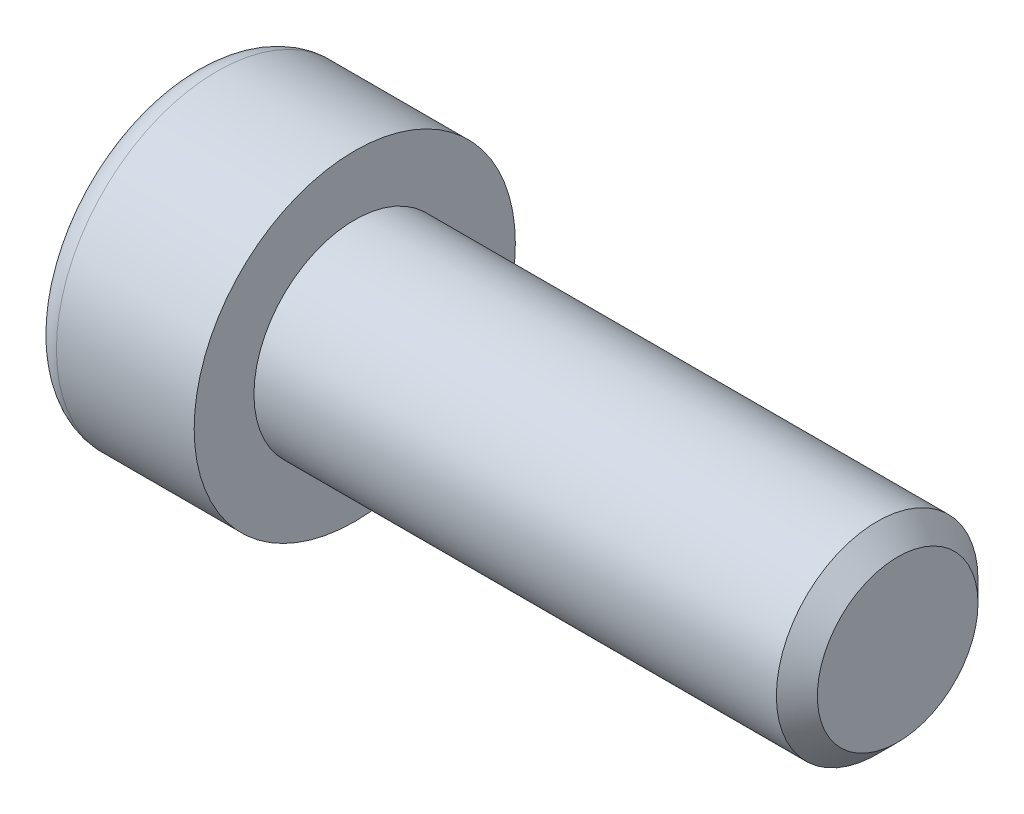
ISO-10303-21;
HEADER;
FILE_DESCRIPTION(('STEP AP214'),'2;1');
FILE_NAME('part.step','',(''),(''),'','','');
FILE_SCHEMA(('AUTOMOTIVE_DESIGN { 1 0 10303 214 1 1 1 1 }'));
ENDSEC;
DATA;
#1=APPLICATION_CONTEXT('core data for automotive mechanical design processes');
#2=APPLICATION_PROTOCOL_DEFINITION('international standard','automotive_design',2000,#1);
#3=PRODUCT_CONTEXT('',#1,'mechanical');
#4=PRODUCT('Part','Part','',(#3));
#5=PRODUCT_RELATED_PRODUCT_CATEGORY('part','',(#4));
#6=PRODUCT_DEFINITION_FORMATION('','',#4);
#7=PRODUCT_DEFINITION_CONTEXT('part definition',#1,'design');
#8=PRODUCT_DEFINITION('design','',#6,#7);
#9=PRODUCT_DEFINITION_SHAPE('','',#8);
#10=(LENGTH_UNIT() NAMED_UNIT(*) SI_UNIT(.MILLI.,.METRE.));
#11=(NAMED_UNIT(*) PLANE_ANGLE_UNIT() SI_UNIT($,.RADIAN.));
#12=(NAMED_UNIT(*) SI_UNIT($,.STERADIAN.) SOLID_ANGLE_UNIT());
#13=UNCERTAINTY_MEASURE_WITH_UNIT(LENGTH_MEASURE(1.E-05),#10,'distance_accuracy_value','');
#14=(GEOMETRIC_REPRESENTATION_CONTEXT(3) GLOBAL_UNCERTAINTY_ASSIGNED_CONTEXT((#13)) GLOBAL_UNIT_ASSIGNED_CONTEXT((#10,
#11,#12)) REPRESENTATION_CONTEXT('',''));
#15=CARTESIAN_POINT('',(0.,0.,0.));
#16=DIRECTION('',(0.,0.,1.));
#17=DIRECTION('',(1.,0.,0.));
#18=AXIS2_PLACEMENT_3D('',#15,#16,#17);
#19=CARTESIAN_POINT('',(-410.916586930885,342.451739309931,0.));
#20=DIRECTION('',(1.,0.,0.));
#21=DIRECTION('',(0.,0.,-1.));
#22=AXIS2_PLACEMENT_3D('',#19,#20,#21);
#23=TOROIDAL_SURFACE('',#22,5.37136329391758,1.00000000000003);
#24=CARTESIAN_POINT('',(-411.916586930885,342.451739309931,0.));
#25=DIRECTION('',(1.,0.,0.));
#26=DIRECTION('',(0.,0.,-1.));
#27=AXIS2_PLACEMENT_3D('',#24,#25,#26);
#28=CIRCLE('',#27,5.37136329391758);
#29=CARTESIAN_POINT('',(-411.916586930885,342.451739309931,-5.37136329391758));
#30=VERTEX_POINT('',#29);
#31=EDGE_CURVE('E161',#30,#30,#28,.T.);
#32=ORIENTED_EDGE('',*,*,#31,.T.);
#33=EDGE_LOOP('',(#32));
#34=FACE_BOUND('',#33,.T.);
#35=CARTESIAN_POINT('',(-410.916586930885,342.451739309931,0.));
#36=DIRECTION('',(1.,0.,0.));
#37=DIRECTION('',(0.,0.,-1.));
#38=AXIS2_PLACEMENT_3D('',#35,#36,#37);
#39=CIRCLE('',#38,6.37136329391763);
#40=CARTESIAN_POINT('',(-410.916586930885,342.451739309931,-6.37136329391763));
#41=VERTEX_POINT('',#40);
#42=EDGE_CURVE('E140',#41,#41,#39,.T.);
#43=ORIENTED_EDGE('',*,*,#42,.F.);
#44=EDGE_LOOP('',(#43));
#45=FACE_BOUND('',#44,.T.);
#46=ADVANCED_FACE('F35',(#34,#45),#23,.T.);
#47=CARTESIAN_POINT('',(-411.916586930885,342.451739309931,0.));
#48=DIRECTION('',(-1.,0.,0.));
#49=DIRECTION('',(0.,0.,1.));
#50=AXIS2_PLACEMENT_3D('',#47,#48,#49);
#51=PLANE('',#50);
#52=DIRECTION('',(0.,-0.695106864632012,-0.718906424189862));
#53=VECTOR('',#52,1.);
#54=CARTESIAN_POINT('',(-411.916586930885,345.750700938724,-0.824709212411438));
#55=LINE('',#54,#53);
#56=CARTESIAN_POINT('',(-411.916586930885,345.750700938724,-0.824709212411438));
#57=VERTEX_POINT('',#56);
#58=CARTESIAN_POINT('',(-411.916586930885,343.387000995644,-3.26933918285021));
#59=VERTEX_POINT('',#58);
#60=EDGE_CURVE('E121',#57,#59,#55,.T.);
#61=ORIENTED_EDGE('',*,*,#60,.F.);
#62=DIRECTION('',(0.,0.275037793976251,-0.961433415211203));
#63=VECTOR('',#62,1.);
#64=CARTESIAN_POINT('',(-411.916586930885,344.815439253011,2.44462997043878));
#65=LINE('',#64,#63);
#66=CARTESIAN_POINT('',(-411.916586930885,344.815439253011,2.44462997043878));
#67=VERTEX_POINT('',#66);
#68=EDGE_CURVE('E135',#67,#57,#65,.T.);
#69=ORIENTED_EDGE('',*,*,#68,.F.);
#70=DIRECTION('',(0.,0.970144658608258,-0.242526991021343));
#71=VECTOR('',#70,1.);
#72=CARTESIAN_POINT('',(-411.916586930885,341.516477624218,3.26933918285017));
#73=LINE('',#72,#71);
#74=CARTESIAN_POINT('',(-411.916586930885,341.516477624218,3.26933918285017));
#75=VERTEX_POINT('',#74);
#76=EDGE_CURVE('E129',#75,#67,#73,.T.);
#77=ORIENTED_EDGE('',*,*,#76,.F.);
#78=DIRECTION('',(0.,0.695106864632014,0.71890642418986));
#79=VECTOR('',#78,1.);
#80=CARTESIAN_POINT('',(-411.916586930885,339.152777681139,0.824709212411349));
#81=LINE('',#80,#79);
#82=CARTESIAN_POINT('',(-411.916586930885,339.152777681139,0.824709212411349));
#83=VERTEX_POINT('',#82);
#84=EDGE_CURVE('E127',#83,#75,#81,.T.);
#85=ORIENTED_EDGE('',*,*,#84,.F.);
#86=DIRECTION('',(0.,-0.275037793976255,0.961433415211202));
#87=VECTOR('',#86,1.);
#88=CARTESIAN_POINT('',(-411.916586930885,340.088039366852,-2.44462997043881));
#89=LINE('',#88,#87);
#90=CARTESIAN_POINT('',(-411.916586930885,340.088039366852,-2.44462997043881));
#91=VERTEX_POINT('',#90);
#92=EDGE_CURVE('E109',#91,#83,#89,.T.);
#93=ORIENTED_EDGE('',*,*,#92,.F.);
#94=DIRECTION('',(0.,-0.970144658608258,0.242526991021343));
#95=VECTOR('',#94,1.);
#96=CARTESIAN_POINT('',(-411.916586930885,343.387000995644,-3.26933918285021));
#97=LINE('',#96,#95);
#98=EDGE_CURVE('E116',#59,#91,#97,.T.);
#99=ORIENTED_EDGE('',*,*,#98,.F.);
#100=EDGE_LOOP('',(#61,#69,#77,#85,#93,#99));
#101=FACE_BOUND('',#100,.T.);
#102=ORIENTED_EDGE('',*,*,#31,.F.);
#103=EDGE_LOOP('',(#102));
#104=FACE_BOUND('',#103,.T.);
#105=ADVANCED_FACE('F123',(#101,#104),#51,.T.);
#106=CARTESIAN_POINT('',(-383.911125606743,345.638750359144,0.));
#107=DIRECTION('',(1.,0.,0.));
#108=DIRECTION('',(0.,0.,-1.));
#109=AXIS2_PLACEMENT_3D('',#106,#107,#108);
#110=PLANE('',#109);
#111=CARTESIAN_POINT('',(-383.911125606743,342.451739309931,0.));
#112=DIRECTION('',(1.,0.,0.));
#113=DIRECTION('',(0.,0.,-1.));
#114=AXIS2_PLACEMENT_3D('',#111,#112,#113);
#115=CIRCLE('',#114,3.18701104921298);
#116=CARTESIAN_POINT('',(-383.911125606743,342.451739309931,-3.18701104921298));
#117=VERTEX_POINT('',#116);
#118=EDGE_CURVE('E158',#117,#117,#115,.T.);
#119=ORIENTED_EDGE('',*,*,#118,.T.);
#120=EDGE_LOOP('',(#119));
#121=FACE_BOUND('',#120,.T.);
#122=ADVANCED_FACE('F252',(#121),#110,.T.);
#123=CARTESIAN_POINT('',(-383.911125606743,342.451739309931,0.));
#124=DIRECTION('',(-1.,0.,0.));
#125=DIRECTION('',(0.,0.,1.));
#126=AXIS2_PLACEMENT_3D('',#123,#124,#125);
#127=CONICAL_SURFACE('',#126,3.18701104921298,0.785398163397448);
#128=CARTESIAN_POINT('',(-384.72411455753,342.451739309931,0.));
#129=DIRECTION('',(1.,0.,0.));
#130=DIRECTION('',(0.,0.,-1.));
#131=AXIS2_PLACEMENT_3D('',#128,#129,#130);
#132=CIRCLE('',#131,4.00000000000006);
#133=CARTESIAN_POINT('',(-384.72411455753,342.451739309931,-4.00000000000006));
#134=VERTEX_POINT('',#133);
#135=EDGE_CURVE('E155',#134,#134,#132,.T.);
#136=ORIENTED_EDGE('',*,*,#135,.T.);
#137=EDGE_LOOP('',(#136));
#138=FACE_BOUND('',#137,.T.);
#139=ORIENTED_EDGE('',*,*,#118,.F.);
#140=EDGE_LOOP('',(#139));
#141=FACE_BOUND('',#140,.T.);
#142=ADVANCED_FACE('F370',(#138,#141),#127,.T.);
#143=CARTESIAN_POINT('',(-383.911125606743,342.451739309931,0.));
#144=DIRECTION('',(1.,0.,0.));
#145=DIRECTION('',(0.,0.,-1.));
#146=AXIS2_PLACEMENT_3D('',#143,#144,#145);
#147=CYLINDRICAL_SURFACE('',#146,4.00000000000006);
#148=CARTESIAN_POINT('',(-405.451180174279,342.451739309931,0.));
#149=DIRECTION('',(1.,0.,0.));
#150=DIRECTION('',(0.,0.,-1.));
#151=AXIS2_PLACEMENT_3D('',#148,#149,#150);
#152=CIRCLE('',#151,4.00000000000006);
#153=CARTESIAN_POINT('',(-405.451180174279,342.451739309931,-4.00000000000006));
#154=VERTEX_POINT('',#153);
#155=EDGE_CURVE('E152',#154,#154,#152,.T.);
#156=ORIENTED_EDGE('',*,*,#155,.T.);
#157=EDGE_LOOP('',(#156));
#158=FACE_BOUND('',#157,.T.);
#159=ORIENTED_EDGE('',*,*,#135,.F.);
#160=EDGE_LOOP('',(#159));
#161=FACE_BOUND('',#160,.T.);
#162=ADVANCED_FACE('F361',(#158,#161),#147,.T.);
#163=CARTESIAN_POINT('',(-405.451180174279,346.451739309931,0.));
#164=DIRECTION('',(1.,0.,0.));
#165=DIRECTION('',(0.,0.,-1.));
#166=AXIS2_PLACEMENT_3D('',#163,#164,#165);
#167=PLANE('',#166);
#168=CARTESIAN_POINT('',(-405.451180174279,342.451739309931,0.));
#169=DIRECTION('',(1.,0.,0.));
#170=DIRECTION('',(0.,0.,-1.));
#171=AXIS2_PLACEMENT_3D('',#168,#169,#170);
#172=CIRCLE('',#171,6.37136329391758);
#173=CARTESIAN_POINT('',(-405.451180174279,342.451739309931,-6.37136329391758));
#174=VERTEX_POINT('',#173);
#175=EDGE_CURVE('E149',#174,#174,#172,.T.);
#176=ORIENTED_EDGE('',*,*,#175,.T.);
#177=EDGE_LOOP('',(#176));
#178=FACE_BOUND('',#177,.T.);
#179=ORIENTED_EDGE('',*,*,#155,.F.);
#180=EDGE_LOOP('',(#179));
#181=FACE_BOUND('',#180,.T.);
#182=ADVANCED_FACE('F352',(#178,#181),#167,.T.);
#183=CARTESIAN_POINT('',(-383.911125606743,342.451739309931,0.));
#184=DIRECTION('',(1.,0.,0.));
#185=DIRECTION('',(0.,0.,-1.));
#186=AXIS2_PLACEMENT_3D('',#183,#184,#185);
#187=CYLINDRICAL_SURFACE('',#186,6.3713632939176);
#188=ORIENTED_EDGE('',*,*,#42,.T.);
#189=EDGE_LOOP('',(#188));
#190=FACE_BOUND('',#189,.T.);
#191=ORIENTED_EDGE('',*,*,#175,.F.);
#192=EDGE_LOOP('',(#191));
#193=FACE_BOUND('',#192,.T.);
#194=ADVANCED_FACE('F343',(#190,#193),#187,.T.);
#195=CARTESIAN_POINT('',(-408.916586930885,345.750700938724,-0.824709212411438));
#196=DIRECTION('',(0.,0.718906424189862,-0.695106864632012));
#197=DIRECTION('',(0.,0.695106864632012,0.718906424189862));
#198=AXIS2_PLACEMENT_3D('',#195,#196,#197);
#199=PLANE('',#198);
#200=DIRECTION('',(-1.,0.,0.));
#201=VECTOR('',#200,1.);
#202=CARTESIAN_POINT('',(-408.916586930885,343.387000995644,-3.26933918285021));
#203=LINE('',#202,#201);
#204=CARTESIAN_POINT('',(-409.416586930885,343.387000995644,-3.26933918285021));
#205=VERTEX_POINT('',#204);
#206=EDGE_CURVE('E113',#205,#59,#203,.T.);
#207=ORIENTED_EDGE('',*,*,#206,.F.);
#208=DIRECTION('',(0.,-0.695106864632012,-0.718906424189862));
#209=VECTOR('',#208,1.);
#210=CARTESIAN_POINT('',(-409.416586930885,345.750700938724,-0.824709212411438));
#211=LINE('',#210,#209);
#212=CARTESIAN_POINT('',(-409.416586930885,345.750700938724,-0.824709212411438));
#213=VERTEX_POINT('',#212);
#214=EDGE_CURVE('E11',#205,#213,#211,.F.);
#215=ORIENTED_EDGE('',*,*,#214,.T.);
#216=DIRECTION('',(-1.,0.,0.));
#217=VECTOR('',#216,1.);
#218=CARTESIAN_POINT('',(-408.916586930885,345.750700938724,-0.824709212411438));
#219=LINE('',#218,#217);
#220=EDGE_CURVE('E138',#213,#57,#219,.T.);
#221=ORIENTED_EDGE('',*,*,#220,.T.);
#222=ORIENTED_EDGE('',*,*,#60,.T.);
#223=EDGE_LOOP('',(#207,#215,#221,#222));
#224=FACE_BOUND('',#223,.T.);
#225=ADVANCED_FACE('F205',(#224),#199,.F.);
#226=CARTESIAN_POINT('',(-408.916586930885,344.815439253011,2.44462997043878));
#227=DIRECTION('',(0.,0.961433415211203,0.275037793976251));
#228=DIRECTION('',(0.,-0.275037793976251,0.961433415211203));
#229=AXIS2_PLACEMENT_3D('',#226,#227,#228);
#230=PLANE('',#229);
#231=ORIENTED_EDGE('',*,*,#220,.F.);
#232=DIRECTION('',(0.,0.275037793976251,-0.961433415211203));
#233=VECTOR('',#232,1.);
#234=CARTESIAN_POINT('',(-409.416586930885,344.815439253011,2.44462997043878));
#235=LINE('',#234,#233);
#236=CARTESIAN_POINT('',(-409.416586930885,344.815439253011,2.44462997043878));
#237=VERTEX_POINT('',#236);
#238=EDGE_CURVE('E177',#213,#237,#235,.F.);
#239=ORIENTED_EDGE('',*,*,#238,.T.);
#240=DIRECTION('',(-1.,0.,0.));
#241=VECTOR('',#240,1.);
#242=CARTESIAN_POINT('',(-408.916586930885,344.815439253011,2.44462997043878));
#243=LINE('',#242,#241);
#244=EDGE_CURVE('E141',#237,#67,#243,.T.);
#245=ORIENTED_EDGE('',*,*,#244,.T.);
#246=ORIENTED_EDGE('',*,*,#68,.T.);
#247=EDGE_LOOP('',(#231,#239,#245,#246));
#248=FACE_BOUND('',#247,.T.);
#249=ADVANCED_FACE('F210',(#248),#230,.F.);
#250=CARTESIAN_POINT('',(-408.916586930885,341.516477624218,3.26933918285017));
#251=DIRECTION('',(0.,0.242526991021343,0.970144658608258));
#252=DIRECTION('',(0.,-0.970144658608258,0.242526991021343));
#253=AXIS2_PLACEMENT_3D('',#250,#251,#252);
#254=PLANE('',#253);
#255=ORIENTED_EDGE('',*,*,#244,.F.);
#256=DIRECTION('',(0.,0.970144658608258,-0.242526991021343));
#257=VECTOR('',#256,1.);
#258=CARTESIAN_POINT('',(-409.416586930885,341.516477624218,3.26933918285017));
#259=LINE('',#258,#257);
#260=CARTESIAN_POINT('',(-409.416586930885,341.516477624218,3.26933918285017));
#261=VERTEX_POINT('',#260);
#262=EDGE_CURVE('E180',#237,#261,#259,.F.);
#263=ORIENTED_EDGE('',*,*,#262,.T.);
#264=DIRECTION('',(-1.,0.,0.));
#265=VECTOR('',#264,1.);
#266=CARTESIAN_POINT('',(-408.916586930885,341.516477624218,3.26933918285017));
#267=LINE('',#266,#265);
#268=EDGE_CURVE('E143',#261,#75,#267,.T.);
#269=ORIENTED_EDGE('',*,*,#268,.T.);
#270=ORIENTED_EDGE('',*,*,#76,.T.);
#271=EDGE_LOOP('',(#255,#263,#269,#270));
#272=FACE_BOUND('',#271,.T.);
#273=ADVANCED_FACE('F214',(#272),#254,.F.);
#274=CARTESIAN_POINT('',(-408.916586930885,339.152777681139,0.824709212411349));
#275=DIRECTION('',(0.,-0.71890642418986,0.695106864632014));
#276=DIRECTION('',(0.,-0.695106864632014,-0.71890642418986));
#277=AXIS2_PLACEMENT_3D('',#274,#275,#276);
#278=PLANE('',#277);
#279=ORIENTED_EDGE('',*,*,#268,.F.);
#280=DIRECTION('',(0.,0.695106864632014,0.71890642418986));
#281=VECTOR('',#280,1.);
#282=CARTESIAN_POINT('',(-409.416586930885,339.152777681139,0.824709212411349));
#283=LINE('',#282,#281);
#284=CARTESIAN_POINT('',(-409.416586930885,339.152777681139,0.824709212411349));
#285=VERTEX_POINT('',#284);
#286=EDGE_CURVE('E182',#261,#285,#283,.F.);
#287=ORIENTED_EDGE('',*,*,#286,.T.);
#288=DIRECTION('',(-1.,0.,0.));
#289=VECTOR('',#288,1.);
#290=CARTESIAN_POINT('',(-408.916586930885,339.152777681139,0.824709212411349));
#291=LINE('',#290,#289);
#292=EDGE_CURVE('E112',#285,#83,#291,.T.);
#293=ORIENTED_EDGE('',*,*,#292,.T.);
#294=ORIENTED_EDGE('',*,*,#84,.T.);
#295=EDGE_LOOP('',(#279,#287,#293,#294));
#296=FACE_BOUND('',#295,.T.);
#297=ADVANCED_FACE('F218',(#296),#278,.F.);
#298=CARTESIAN_POINT('',(-408.916586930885,340.088039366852,-2.44462997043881));
#299=DIRECTION('',(0.,-0.961433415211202,-0.275037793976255));
#300=DIRECTION('',(0.,0.275037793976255,-0.961433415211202));
#301=AXIS2_PLACEMENT_3D('',#298,#299,#300);
#302=PLANE('',#301);
#303=ORIENTED_EDGE('',*,*,#292,.F.);
#304=DIRECTION('',(0.,-0.275037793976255,0.961433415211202));
#305=VECTOR('',#304,1.);
#306=CARTESIAN_POINT('',(-409.416586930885,340.088039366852,-2.44462997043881));
#307=LINE('',#306,#305);
#308=CARTESIAN_POINT('',(-409.416586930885,340.088039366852,-2.44462997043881));
#309=VERTEX_POINT('',#308);
#310=EDGE_CURVE('E59',#285,#309,#307,.F.);
#311=ORIENTED_EDGE('',*,*,#310,.T.);
#312=DIRECTION('',(-1.,0.,0.));
#313=VECTOR('',#312,1.);
#314=CARTESIAN_POINT('',(-408.916586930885,340.088039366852,-2.44462997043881));
#315=LINE('',#314,#313);
#316=EDGE_CURVE('E105',#309,#91,#315,.T.);
#317=ORIENTED_EDGE('',*,*,#316,.T.);
#318=ORIENTED_EDGE('',*,*,#92,.T.);
#319=EDGE_LOOP('',(#303,#311,#317,#318));
#320=FACE_BOUND('',#319,.T.);
#321=ADVANCED_FACE('F107',(#320),#302,.F.);
#322=CARTESIAN_POINT('',(-408.916586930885,343.387000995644,-3.26933918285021));
#323=DIRECTION('',(0.,-0.242526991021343,-0.970144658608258));
#324=DIRECTION('',(0.,0.970144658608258,-0.242526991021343));
#325=AXIS2_PLACEMENT_3D('',#322,#323,#324);
#326=PLANE('',#325);
#327=ORIENTED_EDGE('',*,*,#316,.F.);
#328=DIRECTION('',(0.,-0.970144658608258,0.242526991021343));
#329=VECTOR('',#328,1.);
#330=CARTESIAN_POINT('',(-409.416586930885,343.387000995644,-3.26933918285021));
#331=LINE('',#330,#329);
#332=EDGE_CURVE('E44',#309,#205,#331,.F.);
#333=ORIENTED_EDGE('',*,*,#332,.T.);
#334=ORIENTED_EDGE('',*,*,#206,.T.);
#335=ORIENTED_EDGE('',*,*,#98,.T.);
#336=EDGE_LOOP('',(#327,#333,#334,#335));
#337=FACE_BOUND('',#336,.T.);
#338=ADVANCED_FACE('F117',(#337),#326,.F.);
#339=CARTESIAN_POINT('',(-408.916586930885,343.387000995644,-3.26933918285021));
#340=DIRECTION('',(-1.,0.,0.));
#341=DIRECTION('',(0.,0.,1.));
#342=AXIS2_PLACEMENT_3D('',#339,#340,#341);
#343=PLANE('',#342);
#344=DIRECTION('',(0.,0.970144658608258,-0.242526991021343));
#345=VECTOR('',#344,1.);
#346=CARTESIAN_POINT('',(-408.916586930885,344.6941757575,1.95955764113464));
#347=LINE('',#346,#345);
#348=CARTESIAN_POINT('',(-408.916586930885,341.675270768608,2.71425534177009));
#349=VERTEX_POINT('',#348);
#350=CARTESIAN_POINT('',(-408.916586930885,344.4141191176,2.02956915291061));
#351=VERTEX_POINT('',#350);
#352=EDGE_CURVE('E172',#349,#351,#347,.T.);
#353=ORIENTED_EDGE('',*,*,#352,.T.);
#354=DIRECTION('',(0.,0.275037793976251,-0.961433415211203));
#355=VECTOR('',#354,1.);
#356=CARTESIAN_POINT('',(-408.916586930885,345.737615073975,-2.59689770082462));
#357=LINE('',#356,#355);
#358=CARTESIAN_POINT('',(-408.916586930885,345.190587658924,-0.684686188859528));
#359=VERTEX_POINT('',#358);
#360=EDGE_CURVE('E174',#351,#359,#357,.T.);
#361=ORIENTED_EDGE('',*,*,#360,.T.);
#362=DIRECTION('',(0.,-0.695106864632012,-0.718906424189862));
#363=VECTOR('',#362,1.);
#364=CARTESIAN_POINT('',(-408.916586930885,343.027547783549,-2.92178575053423));
#365=LINE('',#364,#363);
#366=CARTESIAN_POINT('',(-408.916586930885,343.228207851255,-2.71425534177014));
#367=VERTEX_POINT('',#366);
#368=EDGE_CURVE('E164',#359,#367,#365,.T.);
#369=ORIENTED_EDGE('',*,*,#368,.T.);
#370=DIRECTION('',(0.,-0.970144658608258,0.242526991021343));
#371=VECTOR('',#370,1.);
#372=CARTESIAN_POINT('',(-408.916586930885,343.508264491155,-2.78426685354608));
#373=LINE('',#372,#371);
#374=CARTESIAN_POINT('',(-408.916586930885,340.489359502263,-2.02956915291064));
#375=VERTEX_POINT('',#374);
#376=EDGE_CURVE('E166',#367,#375,#373,.T.);
#377=ORIENTED_EDGE('',*,*,#376,.T.);
#378=DIRECTION('',(0.,-0.275037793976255,0.961433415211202));
#379=VECTOR('',#378,1.);
#380=CARTESIAN_POINT('',(-408.916586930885,341.036386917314,-3.94178066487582));
#381=LINE('',#380,#379);
#382=CARTESIAN_POINT('',(-408.916586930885,339.712890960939,0.684686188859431));
#383=VERTEX_POINT('',#382);
#384=EDGE_CURVE('E168',#375,#383,#381,.T.);
#385=ORIENTED_EDGE('',*,*,#384,.T.);
#386=DIRECTION('',(0.,0.695106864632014,0.71890642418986));
#387=VECTOR('',#386,1.);
#388=CARTESIAN_POINT('',(-408.916586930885,339.512230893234,0.477155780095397));
#389=LINE('',#388,#387);
#390=EDGE_CURVE('E170',#383,#349,#389,.T.);
#391=ORIENTED_EDGE('',*,*,#390,.T.);
#392=EDGE_LOOP('',(#353,#361,#369,#377,#385,#391));
#393=FACE_BOUND('',#392,.T.);
#394=ADVANCED_FACE('F237',(#393),#343,.T.);
#395=CARTESIAN_POINT('',(-409.416586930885,341.036386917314,-3.94178066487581));
#396=DIRECTION('',(0.,-0.275037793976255,0.961433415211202));
#397=DIRECTION('',(0.,-0.961433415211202,-0.275037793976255));
#398=AXIS2_PLACEMENT_3D('',#395,#396,#397);
#399=CYLINDRICAL_SURFACE('',#398,0.5);
#400=CARTESIAN_POINT('',(-409.416586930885,340.489359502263,-2.02956915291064));
#401=DIRECTION('',(0.,-0.718906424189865,0.695106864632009));
#402=DIRECTION('',(0.,0.695106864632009,0.718906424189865));
#403=AXIS2_PLACEMENT_3D('',#400,#401,#402);
#404=ELLIPSE('',#403,0.577350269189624,0.5);
#405=EDGE_CURVE('E195',#309,#375,#404,.T.);
#406=ORIENTED_EDGE('',*,*,#405,.F.);
#407=ORIENTED_EDGE('',*,*,#310,.F.);
#408=CARTESIAN_POINT('',(-409.416586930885,339.712890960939,0.684686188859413));
#409=DIRECTION('',(0.,0.242526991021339,0.970144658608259));
#410=DIRECTION('',(0.,0.970144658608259,-0.242526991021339));
#411=AXIS2_PLACEMENT_3D('',#408,#409,#410);
#412=ELLIPSE('',#411,0.577350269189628,0.5);
#413=EDGE_CURVE('E39',#383,#285,#412,.F.);
#414=ORIENTED_EDGE('',*,*,#413,.F.);
#415=ORIENTED_EDGE('',*,*,#384,.F.);
#416=EDGE_LOOP('',(#406,#407,#414,#415));
#417=FACE_BOUND('',#416,.T.);
#418=ADVANCED_FACE('F37',(#417),#399,.F.);
#419=CARTESIAN_POINT('',(-409.416586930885,339.512230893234,0.477155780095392));
#420=DIRECTION('',(0.,0.695106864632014,0.71890642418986));
#421=DIRECTION('',(0.,-0.71890642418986,0.695106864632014));
#422=AXIS2_PLACEMENT_3D('',#419,#420,#421);
#423=CYLINDRICAL_SURFACE('',#422,0.5);
#424=ORIENTED_EDGE('',*,*,#413,.T.);
#425=ORIENTED_EDGE('',*,*,#286,.F.);
#426=CARTESIAN_POINT('',(-409.416586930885,341.675270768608,2.71425534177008));
#427=DIRECTION('',(0.,0.961433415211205,0.275037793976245));
#428=DIRECTION('',(0.,0.275037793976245,-0.961433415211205));
#429=AXIS2_PLACEMENT_3D('',#426,#427,#428);
#430=ELLIPSE('',#429,0.577350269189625,0.5);
#431=EDGE_CURVE('E193',#349,#261,#430,.F.);
#432=ORIENTED_EDGE('',*,*,#431,.F.);
#433=ORIENTED_EDGE('',*,*,#390,.F.);
#434=EDGE_LOOP('',(#424,#425,#432,#433));
#435=FACE_BOUND('',#434,.T.);
#436=ADVANCED_FACE('F235',(#435),#423,.F.);
#437=CARTESIAN_POINT('',(-409.416586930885,343.508264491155,-2.78426685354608));
#438=DIRECTION('',(0.,-0.970144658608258,0.242526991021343));
#439=DIRECTION('',(0.,-0.242526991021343,-0.970144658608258));
#440=AXIS2_PLACEMENT_3D('',#437,#438,#439);
#441=CYLINDRICAL_SURFACE('',#440,0.5);
#442=ORIENTED_EDGE('',*,*,#405,.T.);
#443=ORIENTED_EDGE('',*,*,#376,.F.);
#444=CARTESIAN_POINT('',(-409.416586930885,343.228207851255,-2.71425534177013));
#445=DIRECTION('',(0.,-0.961433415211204,-0.275037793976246));
#446=DIRECTION('',(0.,-0.275037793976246,0.961433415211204));
#447=AXIS2_PLACEMENT_3D('',#444,#445,#446);
#448=ELLIPSE('',#447,0.577350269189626,0.5);
#449=EDGE_CURVE('E190',#205,#367,#448,.T.);
#450=ORIENTED_EDGE('',*,*,#449,.F.);
#451=ORIENTED_EDGE('',*,*,#332,.F.);
#452=EDGE_LOOP('',(#442,#443,#450,#451));
#453=FACE_BOUND('',#452,.T.);
#454=ADVANCED_FACE('F221',(#453),#441,.F.);
#455=CARTESIAN_POINT('',(-409.416586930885,344.6941757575,1.95955764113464));
#456=DIRECTION('',(0.,0.970144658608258,-0.242526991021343));
#457=DIRECTION('',(0.,0.242526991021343,0.970144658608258));
#458=AXIS2_PLACEMENT_3D('',#455,#456,#457);
#459=CYLINDRICAL_SURFACE('',#458,0.5);
#460=ORIENTED_EDGE('',*,*,#431,.T.);
#461=ORIENTED_EDGE('',*,*,#262,.F.);
#462=CARTESIAN_POINT('',(-409.416586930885,344.4141191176,2.02956915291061));
#463=DIRECTION('',(0.,0.718906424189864,-0.695106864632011));
#464=DIRECTION('',(0.,-0.69510686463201,-0.718906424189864));
#465=AXIS2_PLACEMENT_3D('',#462,#463,#464);
#466=ELLIPSE('',#465,0.577350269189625,0.5);
#467=EDGE_CURVE('E188',#351,#237,#466,.F.);
#468=ORIENTED_EDGE('',*,*,#467,.F.);
#469=ORIENTED_EDGE('',*,*,#352,.F.);
#470=EDGE_LOOP('',(#460,#461,#468,#469));
#471=FACE_BOUND('',#470,.T.);
#472=ADVANCED_FACE('F233',(#471),#459,.F.);
#473=CARTESIAN_POINT('',(-409.416586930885,343.027547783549,-2.92178575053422));
#474=DIRECTION('',(0.,-0.695106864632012,-0.718906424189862));
#475=DIRECTION('',(0.,0.718906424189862,-0.695106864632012));
#476=AXIS2_PLACEMENT_3D('',#473,#474,#475);
#477=CYLINDRICAL_SURFACE('',#476,0.5);
#478=ORIENTED_EDGE('',*,*,#449,.T.);
#479=ORIENTED_EDGE('',*,*,#368,.F.);
#480=CARTESIAN_POINT('',(-409.416586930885,345.190587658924,-0.684686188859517));
#481=DIRECTION('',(0.,-0.24252699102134,-0.970144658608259));
#482=DIRECTION('',(0.,0.970144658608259,-0.24252699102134));
#483=AXIS2_PLACEMENT_3D('',#480,#481,#482);
#484=ELLIPSE('',#483,0.577350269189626,0.5);
#485=EDGE_CURVE('E186',#213,#359,#484,.T.);
#486=ORIENTED_EDGE('',*,*,#485,.F.);
#487=ORIENTED_EDGE('',*,*,#214,.F.);
#488=EDGE_LOOP('',(#478,#479,#486,#487));
#489=FACE_BOUND('',#488,.T.);
#490=ADVANCED_FACE('F226',(#489),#477,.F.);
#491=CARTESIAN_POINT('',(-409.416586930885,345.737615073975,-2.59689770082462));
#492=DIRECTION('',(0.,0.275037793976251,-0.961433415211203));
#493=DIRECTION('',(0.,0.961433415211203,0.275037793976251));
#494=AXIS2_PLACEMENT_3D('',#491,#492,#493);
#495=CYLINDRICAL_SURFACE('',#494,0.5);
#496=ORIENTED_EDGE('',*,*,#467,.T.);
#497=ORIENTED_EDGE('',*,*,#238,.F.);
#498=ORIENTED_EDGE('',*,*,#485,.T.);
#499=ORIENTED_EDGE('',*,*,#360,.F.);
#500=EDGE_LOOP('',(#496,#497,#498,#499));
#501=FACE_BOUND('',#500,.T.);
#502=ADVANCED_FACE('F229',(#501),#495,.F.);
#503=CLOSED_SHELL('',(#46,#105,#122,#142,#162,#182,#194,#225,#249,#273,#297,#321,#338,#394,#418,
#436,#454,#472,#490,#502));
#504=MANIFOLD_SOLID_BREP('B2',#503);
#505=ADVANCED_BREP_SHAPE_REPRESENTATION('',(#18,#504),#14);
#506=SHAPE_DEFINITION_REPRESENTATION(#9,#505);
ENDSEC;
END-ISO-10303-21;
